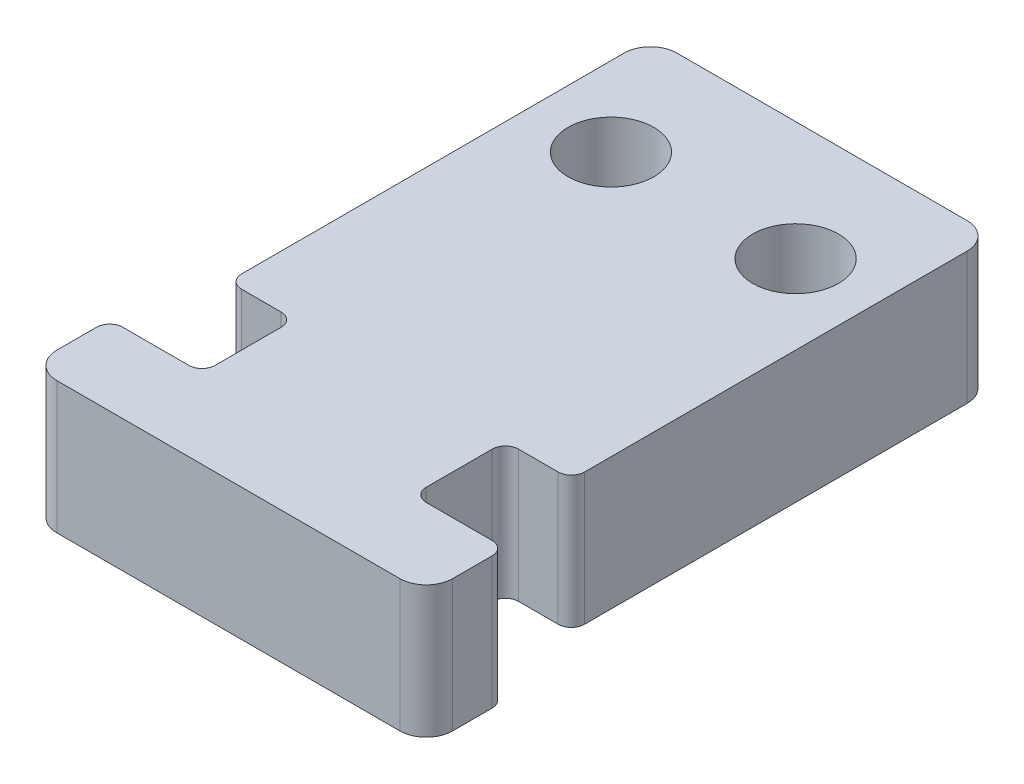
ISO-10303-21;
HEADER;
FILE_DESCRIPTION(('STEP AP214'),'2;1');
FILE_NAME('part.step','',(''),(''),'','','');
FILE_SCHEMA(('AUTOMOTIVE_DESIGN { 1 0 10303 214 1 1 1 1 }'));
ENDSEC;
DATA;
#1=APPLICATION_CONTEXT('core data for automotive mechanical design processes');
#2=APPLICATION_PROTOCOL_DEFINITION('international standard','automotive_design',2000,#1);
#3=PRODUCT_CONTEXT('',#1,'mechanical');
#4=PRODUCT('Part','Part','',(#3));
#5=PRODUCT_RELATED_PRODUCT_CATEGORY('part','',(#4));
#6=PRODUCT_DEFINITION_FORMATION('','',#4);
#7=PRODUCT_DEFINITION_CONTEXT('part definition',#1,'design');
#8=PRODUCT_DEFINITION('design','',#6,#7);
#9=PRODUCT_DEFINITION_SHAPE('','',#8);
#10=(LENGTH_UNIT() NAMED_UNIT(*) SI_UNIT(.MILLI.,.METRE.));
#11=(NAMED_UNIT(*) PLANE_ANGLE_UNIT() SI_UNIT($,.RADIAN.));
#12=(NAMED_UNIT(*) SI_UNIT($,.STERADIAN.) SOLID_ANGLE_UNIT());
#13=UNCERTAINTY_MEASURE_WITH_UNIT(LENGTH_MEASURE(1.E-05),#10,'distance_accuracy_value','');
#14=(GEOMETRIC_REPRESENTATION_CONTEXT(3) GLOBAL_UNCERTAINTY_ASSIGNED_CONTEXT((#13)) GLOBAL_UNIT_ASSIGNED_CONTEXT((#10,
#11,#12)) REPRESENTATION_CONTEXT('',''));
#15=CARTESIAN_POINT('',(0.,0.,0.));
#16=DIRECTION('',(0.,0.,1.));
#17=DIRECTION('',(1.,0.,0.));
#18=AXIS2_PLACEMENT_3D('',#15,#16,#17);
#19=CARTESIAN_POINT('',(-15.,10.,-6.));
#20=DIRECTION('',(1.,0.,0.));
#21=DIRECTION('',(0.,0.,-1.));
#22=AXIS2_PLACEMENT_3D('',#19,#20,#21);
#23=PLANE('',#22);
#24=DIRECTION('',(0.,0.,1.));
#25=VECTOR('',#24,1.);
#26=CARTESIAN_POINT('',(-15.,10.,-6.));
#27=LINE('',#26,#25);
#28=CARTESIAN_POINT('',(-15.,10.,-5.));
#29=VERTEX_POINT('',#28);
#30=CARTESIAN_POINT('',(-15.,10.,-2.));
#31=VERTEX_POINT('',#30);
#32=EDGE_CURVE('E259',#29,#31,#27,.T.);
#33=ORIENTED_EDGE('',*,*,#32,.F.);
#34=DIRECTION('',(0.,-1.,0.));
#35=VECTOR('',#34,1.);
#36=CARTESIAN_POINT('',(-15.,10.,-5.));
#37=LINE('',#36,#35);
#38=CARTESIAN_POINT('',(-15.,0.,-5.));
#39=VERTEX_POINT('',#38);
#40=EDGE_CURVE('E342',#29,#39,#37,.T.);
#41=ORIENTED_EDGE('',*,*,#40,.T.);
#42=DIRECTION('',(0.,0.,1.));
#43=VECTOR('',#42,1.);
#44=CARTESIAN_POINT('',(-15.,0.,-6.));
#45=LINE('',#44,#43);
#46=CARTESIAN_POINT('',(-15.,0.,-2.));
#47=VERTEX_POINT('',#46);
#48=EDGE_CURVE('E234',#39,#47,#45,.T.);
#49=ORIENTED_EDGE('',*,*,#48,.T.);
#50=DIRECTION('',(0.,-1.,0.));
#51=VECTOR('',#50,1.);
#52=CARTESIAN_POINT('',(-15.,10.,-2.));
#53=LINE('',#52,#51);
#54=EDGE_CURVE('E278',#47,#31,#53,.F.);
#55=ORIENTED_EDGE('',*,*,#54,.T.);
#56=EDGE_LOOP('',(#33,#41,#49,#55));
#57=FACE_BOUND('',#56,.T.);
#58=ADVANCED_FACE('F39',(#57),#23,.F.);
#59=CARTESIAN_POINT('',(15.,10.,0.));
#60=DIRECTION('',(0.,0.,-1.));
#61=DIRECTION('',(-1.,0.,0.));
#62=AXIS2_PLACEMENT_3D('',#59,#60,#61);
#63=PLANE('',#62);
#64=DIRECTION('',(1.,0.,0.));
#65=VECTOR('',#64,1.);
#66=CARTESIAN_POINT('',(15.,0.,0.));
#67=LINE('',#66,#65);
#68=CARTESIAN_POINT('',(-13.,0.,0.));
#69=VERTEX_POINT('',#68);
#70=CARTESIAN_POINT('',(13.,0.,0.));
#71=VERTEX_POINT('',#70);
#72=EDGE_CURVE('E229',#69,#71,#67,.T.);
#73=ORIENTED_EDGE('',*,*,#72,.T.);
#74=DIRECTION('',(0.,-1.,0.));
#75=VECTOR('',#74,1.);
#76=CARTESIAN_POINT('',(13.,10.,0.));
#77=LINE('',#76,#75);
#78=CARTESIAN_POINT('',(13.,10.,0.));
#79=VERTEX_POINT('',#78);
#80=EDGE_CURVE('E205',#71,#79,#77,.F.);
#81=ORIENTED_EDGE('',*,*,#80,.T.);
#82=DIRECTION('',(1.,0.,0.));
#83=VECTOR('',#82,1.);
#84=CARTESIAN_POINT('',(15.,10.,0.));
#85=LINE('',#84,#83);
#86=CARTESIAN_POINT('',(-13.,10.,0.));
#87=VERTEX_POINT('',#86);
#88=EDGE_CURVE('E412',#87,#79,#85,.T.);
#89=ORIENTED_EDGE('',*,*,#88,.F.);
#90=DIRECTION('',(0.,-1.,0.));
#91=VECTOR('',#90,1.);
#92=CARTESIAN_POINT('',(-13.,10.,0.));
#93=LINE('',#92,#91);
#94=EDGE_CURVE('E210',#87,#69,#93,.T.);
#95=ORIENTED_EDGE('',*,*,#94,.T.);
#96=EDGE_LOOP('',(#73,#81,#89,#95));
#97=FACE_BOUND('',#96,.T.);
#98=ADVANCED_FACE('F427',(#97),#63,.F.);
#99=CARTESIAN_POINT('',(15.,10.,-6.));
#100=DIRECTION('',(-1.,0.,0.));
#101=DIRECTION('',(0.,0.,1.));
#102=AXIS2_PLACEMENT_3D('',#99,#100,#101);
#103=PLANE('',#102);
#104=DIRECTION('',(0.,0.,-1.));
#105=VECTOR('',#104,1.);
#106=CARTESIAN_POINT('',(15.,0.,-6.));
#107=LINE('',#106,#105);
#108=CARTESIAN_POINT('',(15.,0.,-2.));
#109=VERTEX_POINT('',#108);
#110=CARTESIAN_POINT('',(15.,0.,-5.));
#111=VERTEX_POINT('',#110);
#112=EDGE_CURVE('E217',#109,#111,#107,.T.);
#113=ORIENTED_EDGE('',*,*,#112,.T.);
#114=DIRECTION('',(0.,-1.,0.));
#115=VECTOR('',#114,1.);
#116=CARTESIAN_POINT('',(15.,10.,-5.));
#117=LINE('',#116,#115);
#118=CARTESIAN_POINT('',(15.,10.,-5.));
#119=VERTEX_POINT('',#118);
#120=EDGE_CURVE('E340',#111,#119,#117,.F.);
#121=ORIENTED_EDGE('',*,*,#120,.T.);
#122=DIRECTION('',(0.,0.,-1.));
#123=VECTOR('',#122,1.);
#124=CARTESIAN_POINT('',(15.,10.,-6.));
#125=LINE('',#124,#123);
#126=CARTESIAN_POINT('',(15.,10.,-2.));
#127=VERTEX_POINT('',#126);
#128=EDGE_CURVE('E220',#127,#119,#125,.T.);
#129=ORIENTED_EDGE('',*,*,#128,.F.);
#130=DIRECTION('',(0.,-1.,0.));
#131=VECTOR('',#130,1.);
#132=CARTESIAN_POINT('',(15.,10.,-2.));
#133=LINE('',#132,#131);
#134=EDGE_CURVE('E204',#127,#109,#133,.T.);
#135=ORIENTED_EDGE('',*,*,#134,.T.);
#136=EDGE_LOOP('',(#113,#121,#129,#135));
#137=FACE_BOUND('',#136,.T.);
#138=ADVANCED_FACE('F216',(#137),#103,.F.);
#139=CARTESIAN_POINT('',(15.,10.,-6.));
#140=DIRECTION('',(0.,0.,1.));
#141=DIRECTION('',(1.,0.,0.));
#142=AXIS2_PLACEMENT_3D('',#139,#140,#141);
#143=PLANE('',#142);
#144=DIRECTION('',(-1.,0.,0.));
#145=VECTOR('',#144,1.);
#146=CARTESIAN_POINT('',(15.,0.,-6.));
#147=LINE('',#146,#145);
#148=CARTESIAN_POINT('',(14.,0.,-6.));
#149=VERTEX_POINT('',#148);
#150=CARTESIAN_POINT('',(9.,0.,-6.));
#151=VERTEX_POINT('',#150);
#152=EDGE_CURVE('E228',#149,#151,#147,.T.);
#153=ORIENTED_EDGE('',*,*,#152,.T.);
#154=DIRECTION('',(0.,-1.,0.));
#155=VECTOR('',#154,1.);
#156=CARTESIAN_POINT('',(9.,10.,-6.));
#157=LINE('',#156,#155);
#158=CARTESIAN_POINT('',(9.,10.,-6.));
#159=VERTEX_POINT('',#158);
#160=EDGE_CURVE('E338',#151,#159,#157,.F.);
#161=ORIENTED_EDGE('',*,*,#160,.T.);
#162=DIRECTION('',(-1.,0.,0.));
#163=VECTOR('',#162,1.);
#164=CARTESIAN_POINT('',(15.,10.,-6.));
#165=LINE('',#164,#163);
#166=CARTESIAN_POINT('',(14.,10.,-6.));
#167=VERTEX_POINT('',#166);
#168=EDGE_CURVE('E373',#167,#159,#165,.T.);
#169=ORIENTED_EDGE('',*,*,#168,.F.);
#170=DIRECTION('',(0.,-1.,0.));
#171=VECTOR('',#170,1.);
#172=CARTESIAN_POINT('',(14.,10.,-6.));
#173=LINE('',#172,#171);
#174=EDGE_CURVE('E335',#167,#149,#173,.T.);
#175=ORIENTED_EDGE('',*,*,#174,.T.);
#176=EDGE_LOOP('',(#153,#161,#169,#175));
#177=FACE_BOUND('',#176,.T.);
#178=ADVANCED_FACE('F361',(#177),#143,.F.);
#179=CARTESIAN_POINT('',(8.,10.,-13.));
#180=DIRECTION('',(-1.,0.,0.));
#181=DIRECTION('',(0.,0.,1.));
#182=AXIS2_PLACEMENT_3D('',#179,#180,#181);
#183=PLANE('',#182);
#184=DIRECTION('',(0.,0.,-1.));
#185=VECTOR('',#184,1.);
#186=CARTESIAN_POINT('',(8.,0.,-13.));
#187=LINE('',#186,#185);
#188=CARTESIAN_POINT('',(8.,0.,-7.));
#189=VERTEX_POINT('',#188);
#190=CARTESIAN_POINT('',(8.,0.,-12.));
#191=VERTEX_POINT('',#190);
#192=EDGE_CURVE('E232',#189,#191,#187,.T.);
#193=ORIENTED_EDGE('',*,*,#192,.T.);
#194=DIRECTION('',(0.,-1.,0.));
#195=VECTOR('',#194,1.);
#196=CARTESIAN_POINT('',(8.,10.,-12.));
#197=LINE('',#196,#195);
#198=CARTESIAN_POINT('',(8.,10.,-12.));
#199=VERTEX_POINT('',#198);
#200=EDGE_CURVE('E333',#191,#199,#197,.F.);
#201=ORIENTED_EDGE('',*,*,#200,.T.);
#202=DIRECTION('',(0.,0.,-1.));
#203=VECTOR('',#202,1.);
#204=CARTESIAN_POINT('',(8.,10.,-13.));
#205=LINE('',#204,#203);
#206=CARTESIAN_POINT('',(8.,10.,-7.));
#207=VERTEX_POINT('',#206);
#208=EDGE_CURVE('E371',#207,#199,#205,.T.);
#209=ORIENTED_EDGE('',*,*,#208,.F.);
#210=DIRECTION('',(0.,-1.,0.));
#211=VECTOR('',#210,1.);
#212=CARTESIAN_POINT('',(8.,0.,-7.));
#213=LINE('',#212,#211);
#214=EDGE_CURVE('E330',#207,#189,#213,.T.);
#215=ORIENTED_EDGE('',*,*,#214,.T.);
#216=EDGE_LOOP('',(#193,#201,#209,#215));
#217=FACE_BOUND('',#216,.T.);
#218=ADVANCED_FACE('F375',(#217),#183,.F.);
#219=CARTESIAN_POINT('',(13.,10.,-13.));
#220=DIRECTION('',(0.,0.,-1.));
#221=DIRECTION('',(-1.,0.,0.));
#222=AXIS2_PLACEMENT_3D('',#219,#220,#221);
#223=PLANE('',#222);
#224=DIRECTION('',(1.,0.,0.));
#225=VECTOR('',#224,1.);
#226=CARTESIAN_POINT('',(13.,0.,-13.));
#227=LINE('',#226,#225);
#228=CARTESIAN_POINT('',(9.,0.,-13.));
#229=VERTEX_POINT('',#228);
#230=CARTESIAN_POINT('',(12.,0.,-13.));
#231=VERTEX_POINT('',#230);
#232=EDGE_CURVE('E240',#229,#231,#227,.T.);
#233=ORIENTED_EDGE('',*,*,#232,.T.);
#234=DIRECTION('',(0.,-1.,0.));
#235=VECTOR('',#234,1.);
#236=CARTESIAN_POINT('',(12.,10.,-13.));
#237=LINE('',#236,#235);
#238=CARTESIAN_POINT('',(12.,10.,-13.));
#239=VERTEX_POINT('',#238);
#240=EDGE_CURVE('E328',#231,#239,#237,.F.);
#241=ORIENTED_EDGE('',*,*,#240,.T.);
#242=DIRECTION('',(1.,0.,0.));
#243=VECTOR('',#242,1.);
#244=CARTESIAN_POINT('',(13.,10.,-13.));
#245=LINE('',#244,#243);
#246=CARTESIAN_POINT('',(9.,10.,-13.));
#247=VERTEX_POINT('',#246);
#248=EDGE_CURVE('E377',#247,#239,#245,.T.);
#249=ORIENTED_EDGE('',*,*,#248,.F.);
#250=DIRECTION('',(0.,-1.,0.));
#251=VECTOR('',#250,1.);
#252=CARTESIAN_POINT('',(9.,0.,-13.));
#253=LINE('',#252,#251);
#254=EDGE_CURVE('E325',#247,#229,#253,.T.);
#255=ORIENTED_EDGE('',*,*,#254,.T.);
#256=EDGE_LOOP('',(#233,#241,#249,#255));
#257=FACE_BOUND('',#256,.T.);
#258=ADVANCED_FACE('F473',(#257),#223,.F.);
#259=CARTESIAN_POINT('',(13.,10.,-45.));
#260=DIRECTION('',(-1.,0.,0.));
#261=DIRECTION('',(0.,0.,1.));
#262=AXIS2_PLACEMENT_3D('',#259,#260,#261);
#263=PLANE('',#262);
#264=DIRECTION('',(0.,0.,-1.));
#265=VECTOR('',#264,1.);
#266=CARTESIAN_POINT('',(13.,10.,-45.));
#267=LINE('',#266,#265);
#268=CARTESIAN_POINT('',(13.,10.,-14.));
#269=VERTEX_POINT('',#268);
#270=CARTESIAN_POINT('',(13.,10.,-43.));
#271=VERTEX_POINT('',#270);
#272=EDGE_CURVE('E379',#269,#271,#267,.T.);
#273=ORIENTED_EDGE('',*,*,#272,.F.);
#274=DIRECTION('',(0.,-1.,0.));
#275=VECTOR('',#274,1.);
#276=CARTESIAN_POINT('',(13.,10.,-14.));
#277=LINE('',#276,#275);
#278=CARTESIAN_POINT('',(13.,0.,-14.));
#279=VERTEX_POINT('',#278);
#280=EDGE_CURVE('E322',#269,#279,#277,.T.);
#281=ORIENTED_EDGE('',*,*,#280,.T.);
#282=DIRECTION('',(0.,0.,-1.));
#283=VECTOR('',#282,1.);
#284=CARTESIAN_POINT('',(13.,0.,-45.));
#285=LINE('',#284,#283);
#286=CARTESIAN_POINT('',(13.,0.,-43.));
#287=VERTEX_POINT('',#286);
#288=EDGE_CURVE('E243',#279,#287,#285,.T.);
#289=ORIENTED_EDGE('',*,*,#288,.T.);
#290=DIRECTION('',(0.,-1.,0.));
#291=VECTOR('',#290,1.);
#292=CARTESIAN_POINT('',(13.,10.,-43.));
#293=LINE('',#292,#291);
#294=EDGE_CURVE('E289',#287,#271,#293,.F.);
#295=ORIENTED_EDGE('',*,*,#294,.T.);
#296=EDGE_LOOP('',(#273,#281,#289,#295));
#297=FACE_BOUND('',#296,.T.);
#298=ADVANCED_FACE('F479',(#297),#263,.F.);
#299=CARTESIAN_POINT('',(13.,10.,-45.));
#300=DIRECTION('',(0.,0.,1.));
#301=DIRECTION('',(1.,0.,0.));
#302=AXIS2_PLACEMENT_3D('',#299,#300,#301);
#303=PLANE('',#302);
#304=DIRECTION('',(-1.,0.,0.));
#305=VECTOR('',#304,1.);
#306=CARTESIAN_POINT('',(13.,0.,-45.));
#307=LINE('',#306,#305);
#308=CARTESIAN_POINT('',(11.,0.,-45.));
#309=VERTEX_POINT('',#308);
#310=CARTESIAN_POINT('',(-11.,0.,-45.));
#311=VERTEX_POINT('',#310);
#312=EDGE_CURVE('E245',#309,#311,#307,.T.);
#313=ORIENTED_EDGE('',*,*,#312,.T.);
#314=DIRECTION('',(0.,-1.,0.));
#315=VECTOR('',#314,1.);
#316=CARTESIAN_POINT('',(-11.,10.,-45.));
#317=LINE('',#316,#315);
#318=CARTESIAN_POINT('',(-11.,10.,-45.));
#319=VERTEX_POINT('',#318);
#320=EDGE_CURVE('E287',#311,#319,#317,.F.);
#321=ORIENTED_EDGE('',*,*,#320,.T.);
#322=DIRECTION('',(-1.,0.,0.));
#323=VECTOR('',#322,1.);
#324=CARTESIAN_POINT('',(13.,10.,-45.));
#325=LINE('',#324,#323);
#326=CARTESIAN_POINT('',(11.,10.,-45.));
#327=VERTEX_POINT('',#326);
#328=EDGE_CURVE('E385',#327,#319,#325,.T.);
#329=ORIENTED_EDGE('',*,*,#328,.F.);
#330=DIRECTION('',(0.,-1.,0.));
#331=VECTOR('',#330,1.);
#332=CARTESIAN_POINT('',(11.,10.,-45.));
#333=LINE('',#332,#331);
#334=EDGE_CURVE('E284',#327,#309,#333,.T.);
#335=ORIENTED_EDGE('',*,*,#334,.T.);
#336=EDGE_LOOP('',(#313,#321,#329,#335));
#337=FACE_BOUND('',#336,.T.);
#338=ADVANCED_FACE('F487',(#337),#303,.F.);
#339=CARTESIAN_POINT('',(-13.,10.,-45.));
#340=DIRECTION('',(1.,0.,0.));
#341=DIRECTION('',(0.,0.,-1.));
#342=AXIS2_PLACEMENT_3D('',#339,#340,#341);
#343=PLANE('',#342);
#344=DIRECTION('',(0.,0.,1.));
#345=VECTOR('',#344,1.);
#346=CARTESIAN_POINT('',(-13.,0.,-45.));
#347=LINE('',#346,#345);
#348=CARTESIAN_POINT('',(-13.,0.,-43.));
#349=VERTEX_POINT('',#348);
#350=CARTESIAN_POINT('',(-13.,0.,-14.));
#351=VERTEX_POINT('',#350);
#352=EDGE_CURVE('E248',#349,#351,#347,.T.);
#353=ORIENTED_EDGE('',*,*,#352,.T.);
#354=DIRECTION('',(0.,-1.,0.));
#355=VECTOR('',#354,1.);
#356=CARTESIAN_POINT('',(-13.,10.,-14.));
#357=LINE('',#356,#355);
#358=CARTESIAN_POINT('',(-13.,10.,-14.));
#359=VERTEX_POINT('',#358);
#360=EDGE_CURVE('E314',#351,#359,#357,.F.);
#361=ORIENTED_EDGE('',*,*,#360,.T.);
#362=DIRECTION('',(0.,0.,1.));
#363=VECTOR('',#362,1.);
#364=CARTESIAN_POINT('',(-13.,10.,-45.));
#365=LINE('',#364,#363);
#366=CARTESIAN_POINT('',(-13.,10.,-43.));
#367=VERTEX_POINT('',#366);
#368=EDGE_CURVE('E388',#367,#359,#365,.T.);
#369=ORIENTED_EDGE('',*,*,#368,.F.);
#370=DIRECTION('',(0.,-1.,0.));
#371=VECTOR('',#370,1.);
#372=CARTESIAN_POINT('',(-13.,10.,-43.));
#373=LINE('',#372,#371);
#374=EDGE_CURVE('E281',#367,#349,#373,.T.);
#375=ORIENTED_EDGE('',*,*,#374,.T.);
#376=EDGE_LOOP('',(#353,#361,#369,#375));
#377=FACE_BOUND('',#376,.T.);
#378=ADVANCED_FACE('F493',(#377),#343,.F.);
#379=CARTESIAN_POINT('',(-13.,10.,-13.));
#380=DIRECTION('',(0.,0.,-1.));
#381=DIRECTION('',(-1.,0.,0.));
#382=AXIS2_PLACEMENT_3D('',#379,#380,#381);
#383=PLANE('',#382);
#384=DIRECTION('',(1.,0.,0.));
#385=VECTOR('',#384,1.);
#386=CARTESIAN_POINT('',(-13.,0.,-13.));
#387=LINE('',#386,#385);
#388=CARTESIAN_POINT('',(-12.,0.,-13.));
#389=VERTEX_POINT('',#388);
#390=CARTESIAN_POINT('',(-9.,0.,-13.));
#391=VERTEX_POINT('',#390);
#392=EDGE_CURVE('E251',#389,#391,#387,.T.);
#393=ORIENTED_EDGE('',*,*,#392,.T.);
#394=DIRECTION('',(0.,-1.,0.));
#395=VECTOR('',#394,1.);
#396=CARTESIAN_POINT('',(-9.,10.,-13.));
#397=LINE('',#396,#395);
#398=CARTESIAN_POINT('',(-9.,10.,-13.));
#399=VERTEX_POINT('',#398);
#400=EDGE_CURVE('E305',#391,#399,#397,.F.);
#401=ORIENTED_EDGE('',*,*,#400,.T.);
#402=DIRECTION('',(1.,0.,0.));
#403=VECTOR('',#402,1.);
#404=CARTESIAN_POINT('',(-13.,10.,-13.));
#405=LINE('',#404,#403);
#406=CARTESIAN_POINT('',(-12.,10.,-13.));
#407=VERTEX_POINT('',#406);
#408=EDGE_CURVE('E390',#407,#399,#405,.T.);
#409=ORIENTED_EDGE('',*,*,#408,.F.);
#410=DIRECTION('',(0.,-1.,0.));
#411=VECTOR('',#410,1.);
#412=CARTESIAN_POINT('',(-12.,10.,-13.));
#413=LINE('',#412,#411);
#414=EDGE_CURVE('E302',#407,#389,#413,.T.);
#415=ORIENTED_EDGE('',*,*,#414,.T.);
#416=EDGE_LOOP('',(#393,#401,#409,#415));
#417=FACE_BOUND('',#416,.T.);
#418=ADVANCED_FACE('F500',(#417),#383,.F.);
#419=CARTESIAN_POINT('',(-8.,10.,-13.));
#420=DIRECTION('',(1.,0.,0.));
#421=DIRECTION('',(0.,0.,-1.));
#422=AXIS2_PLACEMENT_3D('',#419,#420,#421);
#423=PLANE('',#422);
#424=DIRECTION('',(0.,0.,1.));
#425=VECTOR('',#424,1.);
#426=CARTESIAN_POINT('',(-8.,0.,-13.));
#427=LINE('',#426,#425);
#428=CARTESIAN_POINT('',(-8.,0.,-12.));
#429=VERTEX_POINT('',#428);
#430=CARTESIAN_POINT('',(-8.,0.,-7.));
#431=VERTEX_POINT('',#430);
#432=EDGE_CURVE('E254',#429,#431,#427,.T.);
#433=ORIENTED_EDGE('',*,*,#432,.T.);
#434=DIRECTION('',(0.,-1.,0.));
#435=VECTOR('',#434,1.);
#436=CARTESIAN_POINT('',(-8.,10.,-7.));
#437=LINE('',#436,#435);
#438=CARTESIAN_POINT('',(-8.,10.,-7.));
#439=VERTEX_POINT('',#438);
#440=EDGE_CURVE('E300',#431,#439,#437,.F.);
#441=ORIENTED_EDGE('',*,*,#440,.T.);
#442=DIRECTION('',(0.,0.,1.));
#443=VECTOR('',#442,1.);
#444=CARTESIAN_POINT('',(-8.,10.,-13.));
#445=LINE('',#444,#443);
#446=CARTESIAN_POINT('',(-8.,10.,-12.));
#447=VERTEX_POINT('',#446);
#448=EDGE_CURVE('E393',#447,#439,#445,.T.);
#449=ORIENTED_EDGE('',*,*,#448,.F.);
#450=DIRECTION('',(0.,-1.,0.));
#451=VECTOR('',#450,1.);
#452=CARTESIAN_POINT('',(-8.,0.,-12.));
#453=LINE('',#452,#451);
#454=EDGE_CURVE('E297',#447,#429,#453,.T.);
#455=ORIENTED_EDGE('',*,*,#454,.T.);
#456=EDGE_LOOP('',(#433,#441,#449,#455));
#457=FACE_BOUND('',#456,.T.);
#458=ADVANCED_FACE('F506',(#457),#423,.F.);
#459=CARTESIAN_POINT('',(-15.,10.,-6.));
#460=DIRECTION('',(0.,0.,1.));
#461=DIRECTION('',(1.,0.,0.));
#462=AXIS2_PLACEMENT_3D('',#459,#460,#461);
#463=PLANE('',#462);
#464=DIRECTION('',(-1.,0.,0.));
#465=VECTOR('',#464,1.);
#466=CARTESIAN_POINT('',(-15.,10.,-6.));
#467=LINE('',#466,#465);
#468=CARTESIAN_POINT('',(-9.,10.,-6.));
#469=VERTEX_POINT('',#468);
#470=CARTESIAN_POINT('',(-14.,10.,-6.));
#471=VERTEX_POINT('',#470);
#472=EDGE_CURVE('E222',#469,#471,#467,.T.);
#473=ORIENTED_EDGE('',*,*,#472,.F.);
#474=DIRECTION('',(0.,-1.,0.));
#475=VECTOR('',#474,1.);
#476=CARTESIAN_POINT('',(-9.,0.,-6.));
#477=LINE('',#476,#475);
#478=CARTESIAN_POINT('',(-9.,0.,-6.));
#479=VERTEX_POINT('',#478);
#480=EDGE_CURVE('E294',#469,#479,#477,.T.);
#481=ORIENTED_EDGE('',*,*,#480,.T.);
#482=DIRECTION('',(-1.,0.,0.));
#483=VECTOR('',#482,1.);
#484=CARTESIAN_POINT('',(-15.,0.,-6.));
#485=LINE('',#484,#483);
#486=CARTESIAN_POINT('',(-14.,0.,-6.));
#487=VERTEX_POINT('',#486);
#488=EDGE_CURVE('E257',#479,#487,#485,.T.);
#489=ORIENTED_EDGE('',*,*,#488,.T.);
#490=DIRECTION('',(0.,-1.,0.));
#491=VECTOR('',#490,1.);
#492=CARTESIAN_POINT('',(-14.,10.,-6.));
#493=LINE('',#492,#491);
#494=EDGE_CURVE('E292',#487,#471,#493,.F.);
#495=ORIENTED_EDGE('',*,*,#494,.T.);
#496=EDGE_LOOP('',(#473,#481,#489,#495));
#497=FACE_BOUND('',#496,.T.);
#498=ADVANCED_FACE('F512',(#497),#463,.F.);
#499=CARTESIAN_POINT('',(0.,10.,0.));
#500=DIRECTION('',(0.,-1.,0.));
#501=DIRECTION('',(0.,0.,-1.));
#502=AXIS2_PLACEMENT_3D('',#499,#500,#501);
#503=PLANE('',#502);
#504=CARTESIAN_POINT('',(-6.99999999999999,10.,-36.));
#505=DIRECTION('',(0.,-1.,0.));
#506=DIRECTION('',(0.,0.,1.));
#507=AXIS2_PLACEMENT_3D('',#504,#505,#506);
#508=CIRCLE('',#507,3.25000000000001);
#509=CARTESIAN_POINT('',(-6.99999999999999,10.,-32.75));
#510=VERTEX_POINT('',#509);
#511=EDGE_CURVE('E408',#510,#510,#508,.T.);
#512=ORIENTED_EDGE('',*,*,#511,.T.);
#513=EDGE_LOOP('',(#512));
#514=FACE_BOUND('',#513,.T.);
#515=CARTESIAN_POINT('',(6.99999999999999,10.,-36.));
#516=DIRECTION('',(0.,1.,0.));
#517=DIRECTION('',(0.,0.,1.));
#518=AXIS2_PLACEMENT_3D('',#515,#516,#517);
#519=CIRCLE('',#518,3.25000000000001);
#520=CARTESIAN_POINT('',(6.99999999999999,10.,-32.75));
#521=VERTEX_POINT('',#520);
#522=EDGE_CURVE('E400',#521,#521,#519,.T.);
#523=ORIENTED_EDGE('',*,*,#522,.F.);
#524=EDGE_LOOP('',(#523));
#525=FACE_BOUND('',#524,.T.);
#526=ORIENTED_EDGE('',*,*,#368,.T.);
#527=CARTESIAN_POINT('',(-12.,10.,-14.));
#528=DIRECTION('',(0.,-1.,0.));
#529=DIRECTION('',(0.,0.,-1.));
#530=AXIS2_PLACEMENT_3D('',#527,#528,#529);
#531=CIRCLE('',#530,1.);
#532=EDGE_CURVE('E320',#359,#407,#531,.F.);
#533=ORIENTED_EDGE('',*,*,#532,.T.);
#534=ORIENTED_EDGE('',*,*,#408,.T.);
#535=CARTESIAN_POINT('',(-9.,10.,-12.));
#536=DIRECTION('',(0.,-1.,0.));
#537=DIRECTION('',(0.,0.,-1.));
#538=AXIS2_PLACEMENT_3D('',#535,#536,#537);
#539=CIRCLE('',#538,1.);
#540=EDGE_CURVE('E351',#399,#447,#539,.T.);
#541=ORIENTED_EDGE('',*,*,#540,.T.);
#542=ORIENTED_EDGE('',*,*,#448,.T.);
#543=CARTESIAN_POINT('',(-9.,10.,-7.));
#544=DIRECTION('',(0.,-1.,0.));
#545=DIRECTION('',(0.,0.,-1.));
#546=AXIS2_PLACEMENT_3D('',#543,#544,#545);
#547=CIRCLE('',#546,1.);
#548=EDGE_CURVE('E347',#439,#469,#547,.T.);
#549=ORIENTED_EDGE('',*,*,#548,.T.);
#550=ORIENTED_EDGE('',*,*,#472,.T.);
#551=CARTESIAN_POINT('',(-14.,10.,-5.));
#552=DIRECTION('',(0.,-1.,0.));
#553=DIRECTION('',(0.,0.,-1.));
#554=AXIS2_PLACEMENT_3D('',#551,#552,#553);
#555=CIRCLE('',#554,1.);
#556=EDGE_CURVE('E54',#471,#29,#555,.F.);
#557=ORIENTED_EDGE('',*,*,#556,.T.);
#558=ORIENTED_EDGE('',*,*,#32,.T.);
#559=CARTESIAN_POINT('',(-13.,10.,-2.));
#560=DIRECTION('',(0.,-1.,0.));
#561=DIRECTION('',(0.,0.,-1.));
#562=AXIS2_PLACEMENT_3D('',#559,#560,#561);
#563=CIRCLE('',#562,2.);
#564=EDGE_CURVE('E274',#31,#87,#563,.F.);
#565=ORIENTED_EDGE('',*,*,#564,.T.);
#566=ORIENTED_EDGE('',*,*,#88,.T.);
#567=CARTESIAN_POINT('',(13.,10.,-2.));
#568=DIRECTION('',(0.,-1.,0.));
#569=DIRECTION('',(0.,0.,-1.));
#570=AXIS2_PLACEMENT_3D('',#567,#568,#569);
#571=CIRCLE('',#570,2.);
#572=EDGE_CURVE('E276',#79,#127,#571,.F.);
#573=ORIENTED_EDGE('',*,*,#572,.T.);
#574=ORIENTED_EDGE('',*,*,#128,.T.);
#575=CARTESIAN_POINT('',(14.,10.,-5.));
#576=DIRECTION('',(0.,-1.,0.));
#577=DIRECTION('',(0.,0.,-1.));
#578=AXIS2_PLACEMENT_3D('',#575,#576,#577);
#579=CIRCLE('',#578,1.);
#580=EDGE_CURVE('E317',#119,#167,#579,.F.);
#581=ORIENTED_EDGE('',*,*,#580,.T.);
#582=ORIENTED_EDGE('',*,*,#168,.T.);
#583=CARTESIAN_POINT('',(9.,10.,-7.));
#584=DIRECTION('',(0.,-1.,0.));
#585=DIRECTION('',(0.,0.,-1.));
#586=AXIS2_PLACEMENT_3D('',#583,#584,#585);
#587=CIRCLE('',#586,1.);
#588=EDGE_CURVE('E11',#159,#207,#587,.T.);
#589=ORIENTED_EDGE('',*,*,#588,.T.);
#590=ORIENTED_EDGE('',*,*,#208,.T.);
#591=CARTESIAN_POINT('',(9.,10.,-12.));
#592=DIRECTION('',(0.,-1.,0.));
#593=DIRECTION('',(0.,0.,-1.));
#594=AXIS2_PLACEMENT_3D('',#591,#592,#593);
#595=CIRCLE('',#594,1.);
#596=EDGE_CURVE('E355',#199,#247,#595,.T.);
#597=ORIENTED_EDGE('',*,*,#596,.T.);
#598=ORIENTED_EDGE('',*,*,#248,.T.);
#599=CARTESIAN_POINT('',(12.,10.,-14.));
#600=DIRECTION('',(0.,-1.,0.));
#601=DIRECTION('',(0.,0.,-1.));
#602=AXIS2_PLACEMENT_3D('',#599,#600,#601);
#603=CIRCLE('',#602,1.);
#604=EDGE_CURVE('E61',#239,#269,#603,.F.);
#605=ORIENTED_EDGE('',*,*,#604,.T.);
#606=ORIENTED_EDGE('',*,*,#272,.T.);
#607=CARTESIAN_POINT('',(11.,10.,-43.));
#608=DIRECTION('',(0.,-1.,0.));
#609=DIRECTION('',(0.,0.,-1.));
#610=AXIS2_PLACEMENT_3D('',#607,#608,#609);
#611=CIRCLE('',#610,2.);
#612=EDGE_CURVE('E270',#271,#327,#611,.F.);
#613=ORIENTED_EDGE('',*,*,#612,.T.);
#614=ORIENTED_EDGE('',*,*,#328,.T.);
#615=CARTESIAN_POINT('',(-11.,10.,-43.));
#616=DIRECTION('',(0.,-1.,0.));
#617=DIRECTION('',(0.,0.,-1.));
#618=AXIS2_PLACEMENT_3D('',#615,#616,#617);
#619=CIRCLE('',#618,2.);
#620=EDGE_CURVE('E272',#319,#367,#619,.F.);
#621=ORIENTED_EDGE('',*,*,#620,.T.);
#622=EDGE_LOOP('',(#526,#533,#534,#541,#542,#549,#550,#557,#558,#565,#566,#573,#574,#581,#582,
#589,#590,#597,#598,#605,#606,#613,#614,#621));
#623=FACE_BOUND('',#622,.T.);
#624=ADVANCED_FACE('F370',(#514,#525,#623),#503,.F.);
#625=CARTESIAN_POINT('',(0.,0.,0.));
#626=DIRECTION('',(0.,-1.,0.));
#627=DIRECTION('',(0.,0.,-1.));
#628=AXIS2_PLACEMENT_3D('',#625,#626,#627);
#629=PLANE('',#628);
#630=CARTESIAN_POINT('',(-6.99999999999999,0.,-36.));
#631=DIRECTION('',(0.,-1.,0.));
#632=DIRECTION('',(0.,0.,1.));
#633=AXIS2_PLACEMENT_3D('',#630,#631,#632);
#634=CIRCLE('',#633,3.25000000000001);
#635=CARTESIAN_POINT('',(-6.99999999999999,0.,-32.75));
#636=VERTEX_POINT('',#635);
#637=EDGE_CURVE('E405',#636,#636,#634,.T.);
#638=ORIENTED_EDGE('',*,*,#637,.F.);
#639=EDGE_LOOP('',(#638));
#640=FACE_BOUND('',#639,.T.);
#641=CARTESIAN_POINT('',(6.99999999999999,0.,-36.));
#642=DIRECTION('',(0.,1.,0.));
#643=DIRECTION('',(0.,0.,1.));
#644=AXIS2_PLACEMENT_3D('',#641,#642,#643);
#645=CIRCLE('',#644,3.25000000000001);
#646=CARTESIAN_POINT('',(6.99999999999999,0.,-32.75));
#647=VERTEX_POINT('',#646);
#648=EDGE_CURVE('E396',#647,#647,#645,.T.);
#649=ORIENTED_EDGE('',*,*,#648,.T.);
#650=EDGE_LOOP('',(#649));
#651=FACE_BOUND('',#650,.T.);
#652=ORIENTED_EDGE('',*,*,#392,.F.);
#653=CARTESIAN_POINT('',(-12.,0.,-14.));
#654=DIRECTION('',(0.,-1.,0.));
#655=DIRECTION('',(0.,0.,-1.));
#656=AXIS2_PLACEMENT_3D('',#653,#654,#655);
#657=CIRCLE('',#656,1.);
#658=EDGE_CURVE('E312',#389,#351,#657,.T.);
#659=ORIENTED_EDGE('',*,*,#658,.T.);
#660=ORIENTED_EDGE('',*,*,#352,.F.);
#661=CARTESIAN_POINT('',(-11.,0.,-43.));
#662=DIRECTION('',(0.,-1.,0.));
#663=DIRECTION('',(0.,0.,-1.));
#664=AXIS2_PLACEMENT_3D('',#661,#662,#663);
#665=CIRCLE('',#664,2.);
#666=EDGE_CURVE('E263',#349,#311,#665,.T.);
#667=ORIENTED_EDGE('',*,*,#666,.T.);
#668=ORIENTED_EDGE('',*,*,#312,.F.);
#669=CARTESIAN_POINT('',(11.,0.,-43.));
#670=DIRECTION('',(0.,-1.,0.));
#671=DIRECTION('',(0.,0.,-1.));
#672=AXIS2_PLACEMENT_3D('',#669,#670,#671);
#673=CIRCLE('',#672,2.);
#674=EDGE_CURVE('E221',#309,#287,#673,.T.);
#675=ORIENTED_EDGE('',*,*,#674,.T.);
#676=ORIENTED_EDGE('',*,*,#288,.F.);
#677=CARTESIAN_POINT('',(12.,0.,-14.));
#678=DIRECTION('',(0.,-1.,0.));
#679=DIRECTION('',(0.,0.,-1.));
#680=AXIS2_PLACEMENT_3D('',#677,#678,#679);
#681=CIRCLE('',#680,1.);
#682=EDGE_CURVE('E310',#279,#231,#681,.T.);
#683=ORIENTED_EDGE('',*,*,#682,.T.);
#684=ORIENTED_EDGE('',*,*,#232,.F.);
#685=CARTESIAN_POINT('',(9.,0.,-12.));
#686=DIRECTION('',(0.,-1.,0.));
#687=DIRECTION('',(0.,0.,-1.));
#688=AXIS2_PLACEMENT_3D('',#685,#686,#687);
#689=CIRCLE('',#688,1.);
#690=EDGE_CURVE('E353',#229,#191,#689,.F.);
#691=ORIENTED_EDGE('',*,*,#690,.T.);
#692=ORIENTED_EDGE('',*,*,#192,.F.);
#693=CARTESIAN_POINT('',(9.,0.,-7.));
#694=DIRECTION('',(0.,-1.,0.));
#695=DIRECTION('',(0.,0.,-1.));
#696=AXIS2_PLACEMENT_3D('',#693,#694,#695);
#697=CIRCLE('',#696,1.);
#698=EDGE_CURVE('E47',#189,#151,#697,.F.);
#699=ORIENTED_EDGE('',*,*,#698,.T.);
#700=ORIENTED_EDGE('',*,*,#152,.F.);
#701=CARTESIAN_POINT('',(14.,0.,-5.));
#702=DIRECTION('',(0.,-1.,0.));
#703=DIRECTION('',(0.,0.,-1.));
#704=AXIS2_PLACEMENT_3D('',#701,#702,#703);
#705=CIRCLE('',#704,1.);
#706=EDGE_CURVE('E227',#149,#111,#705,.T.);
#707=ORIENTED_EDGE('',*,*,#706,.T.);
#708=ORIENTED_EDGE('',*,*,#112,.F.);
#709=CARTESIAN_POINT('',(13.,0.,-2.));
#710=DIRECTION('',(0.,-1.,0.));
#711=DIRECTION('',(0.,0.,-1.));
#712=AXIS2_PLACEMENT_3D('',#709,#710,#711);
#713=CIRCLE('',#712,2.);
#714=EDGE_CURVE('E200',#109,#71,#713,.T.);
#715=ORIENTED_EDGE('',*,*,#714,.T.);
#716=ORIENTED_EDGE('',*,*,#72,.F.);
#717=CARTESIAN_POINT('',(-13.,0.,-2.));
#718=DIRECTION('',(0.,-1.,0.));
#719=DIRECTION('',(0.,0.,-1.));
#720=AXIS2_PLACEMENT_3D('',#717,#718,#719);
#721=CIRCLE('',#720,2.);
#722=EDGE_CURVE('E211',#69,#47,#721,.T.);
#723=ORIENTED_EDGE('',*,*,#722,.T.);
#724=ORIENTED_EDGE('',*,*,#48,.F.);
#725=CARTESIAN_POINT('',(-14.,0.,-5.));
#726=DIRECTION('',(0.,-1.,0.));
#727=DIRECTION('',(0.,0.,-1.));
#728=AXIS2_PLACEMENT_3D('',#725,#726,#727);
#729=CIRCLE('',#728,1.);
#730=EDGE_CURVE('E307',#39,#487,#729,.T.);
#731=ORIENTED_EDGE('',*,*,#730,.T.);
#732=ORIENTED_EDGE('',*,*,#488,.F.);
#733=CARTESIAN_POINT('',(-9.,0.,-7.));
#734=DIRECTION('',(0.,-1.,0.));
#735=DIRECTION('',(0.,0.,-1.));
#736=AXIS2_PLACEMENT_3D('',#733,#734,#735);
#737=CIRCLE('',#736,1.);
#738=EDGE_CURVE('E345',#479,#431,#737,.F.);
#739=ORIENTED_EDGE('',*,*,#738,.T.);
#740=ORIENTED_EDGE('',*,*,#432,.F.);
#741=CARTESIAN_POINT('',(-9.,0.,-12.));
#742=DIRECTION('',(0.,-1.,0.));
#743=DIRECTION('',(0.,0.,-1.));
#744=AXIS2_PLACEMENT_3D('',#741,#742,#743);
#745=CIRCLE('',#744,1.);
#746=EDGE_CURVE('E349',#429,#391,#745,.F.);
#747=ORIENTED_EDGE('',*,*,#746,.T.);
#748=EDGE_LOOP('',(#652,#659,#660,#667,#668,#675,#676,#683,#684,#691,#692,#699,#700,#707,#708,
#715,#716,#723,#724,#731,#732,#739,#740,#747));
#749=FACE_BOUND('',#748,.T.);
#750=ADVANCED_FACE('F225',(#640,#651,#749),#629,.T.);
#751=CARTESIAN_POINT('',(13.,10.,-2.));
#752=DIRECTION('',(0.,-1.,0.));
#753=DIRECTION('',(0.,0.,-1.));
#754=AXIS2_PLACEMENT_3D('',#751,#752,#753);
#755=CYLINDRICAL_SURFACE('',#754,2.);
#756=ORIENTED_EDGE('',*,*,#572,.F.);
#757=ORIENTED_EDGE('',*,*,#80,.F.);
#758=ORIENTED_EDGE('',*,*,#714,.F.);
#759=ORIENTED_EDGE('',*,*,#134,.F.);
#760=EDGE_LOOP('',(#756,#757,#758,#759));
#761=FACE_BOUND('',#760,.T.);
#762=ADVANCED_FACE('F203',(#761),#755,.T.);
#763=CARTESIAN_POINT('',(-13.,10.,-2.));
#764=DIRECTION('',(0.,-1.,0.));
#765=DIRECTION('',(0.,0.,-1.));
#766=AXIS2_PLACEMENT_3D('',#763,#764,#765);
#767=CYLINDRICAL_SURFACE('',#766,2.);
#768=ORIENTED_EDGE('',*,*,#564,.F.);
#769=ORIENTED_EDGE('',*,*,#54,.F.);
#770=ORIENTED_EDGE('',*,*,#722,.F.);
#771=ORIENTED_EDGE('',*,*,#94,.F.);
#772=EDGE_LOOP('',(#768,#769,#770,#771));
#773=FACE_BOUND('',#772,.T.);
#774=ADVANCED_FACE('F438',(#773),#767,.T.);
#775=CARTESIAN_POINT('',(-11.,10.,-43.));
#776=DIRECTION('',(0.,-1.,0.));
#777=DIRECTION('',(0.,0.,-1.));
#778=AXIS2_PLACEMENT_3D('',#775,#776,#777);
#779=CYLINDRICAL_SURFACE('',#778,2.);
#780=ORIENTED_EDGE('',*,*,#620,.F.);
#781=ORIENTED_EDGE('',*,*,#320,.F.);
#782=ORIENTED_EDGE('',*,*,#666,.F.);
#783=ORIENTED_EDGE('',*,*,#374,.F.);
#784=EDGE_LOOP('',(#780,#781,#782,#783));
#785=FACE_BOUND('',#784,.T.);
#786=ADVANCED_FACE('F441',(#785),#779,.T.);
#787=CARTESIAN_POINT('',(11.,10.,-43.));
#788=DIRECTION('',(0.,-1.,0.));
#789=DIRECTION('',(0.,0.,-1.));
#790=AXIS2_PLACEMENT_3D('',#787,#788,#789);
#791=CYLINDRICAL_SURFACE('',#790,2.);
#792=ORIENTED_EDGE('',*,*,#612,.F.);
#793=ORIENTED_EDGE('',*,*,#294,.F.);
#794=ORIENTED_EDGE('',*,*,#674,.F.);
#795=ORIENTED_EDGE('',*,*,#334,.F.);
#796=EDGE_LOOP('',(#792,#793,#794,#795));
#797=FACE_BOUND('',#796,.T.);
#798=ADVANCED_FACE('F445',(#797),#791,.T.);
#799=CARTESIAN_POINT('',(-9.,10.,-7.));
#800=DIRECTION('',(0.,1.,0.));
#801=DIRECTION('',(0.,0.,1.));
#802=AXIS2_PLACEMENT_3D('',#799,#800,#801);
#803=CYLINDRICAL_SURFACE('',#802,1.);
#804=ORIENTED_EDGE('',*,*,#548,.F.);
#805=ORIENTED_EDGE('',*,*,#440,.F.);
#806=ORIENTED_EDGE('',*,*,#738,.F.);
#807=ORIENTED_EDGE('',*,*,#480,.F.);
#808=EDGE_LOOP('',(#804,#805,#806,#807));
#809=FACE_BOUND('',#808,.T.);
#810=ADVANCED_FACE('F449',(#809),#803,.F.);
#811=CARTESIAN_POINT('',(-9.,10.,-12.));
#812=DIRECTION('',(0.,1.,0.));
#813=DIRECTION('',(0.,0.,1.));
#814=AXIS2_PLACEMENT_3D('',#811,#812,#813);
#815=CYLINDRICAL_SURFACE('',#814,1.);
#816=ORIENTED_EDGE('',*,*,#540,.F.);
#817=ORIENTED_EDGE('',*,*,#400,.F.);
#818=ORIENTED_EDGE('',*,*,#746,.F.);
#819=ORIENTED_EDGE('',*,*,#454,.F.);
#820=EDGE_LOOP('',(#816,#817,#818,#819));
#821=FACE_BOUND('',#820,.T.);
#822=ADVANCED_FACE('F453',(#821),#815,.F.);
#823=CARTESIAN_POINT('',(-12.,10.,-14.));
#824=DIRECTION('',(0.,-1.,0.));
#825=DIRECTION('',(0.,0.,-1.));
#826=AXIS2_PLACEMENT_3D('',#823,#824,#825);
#827=CYLINDRICAL_SURFACE('',#826,1.);
#828=ORIENTED_EDGE('',*,*,#532,.F.);
#829=ORIENTED_EDGE('',*,*,#360,.F.);
#830=ORIENTED_EDGE('',*,*,#658,.F.);
#831=ORIENTED_EDGE('',*,*,#414,.F.);
#832=EDGE_LOOP('',(#828,#829,#830,#831));
#833=FACE_BOUND('',#832,.T.);
#834=ADVANCED_FACE('F457',(#833),#827,.T.);
#835=CARTESIAN_POINT('',(12.,10.,-14.));
#836=DIRECTION('',(0.,-1.,0.));
#837=DIRECTION('',(0.,0.,-1.));
#838=AXIS2_PLACEMENT_3D('',#835,#836,#837);
#839=CYLINDRICAL_SURFACE('',#838,1.);
#840=ORIENTED_EDGE('',*,*,#604,.F.);
#841=ORIENTED_EDGE('',*,*,#240,.F.);
#842=ORIENTED_EDGE('',*,*,#682,.F.);
#843=ORIENTED_EDGE('',*,*,#280,.F.);
#844=EDGE_LOOP('',(#840,#841,#842,#843));
#845=FACE_BOUND('',#844,.T.);
#846=ADVANCED_FACE('F461',(#845),#839,.T.);
#847=CARTESIAN_POINT('',(9.,10.,-12.));
#848=DIRECTION('',(0.,1.,0.));
#849=DIRECTION('',(0.,0.,1.));
#850=AXIS2_PLACEMENT_3D('',#847,#848,#849);
#851=CYLINDRICAL_SURFACE('',#850,1.);
#852=ORIENTED_EDGE('',*,*,#596,.F.);
#853=ORIENTED_EDGE('',*,*,#200,.F.);
#854=ORIENTED_EDGE('',*,*,#690,.F.);
#855=ORIENTED_EDGE('',*,*,#254,.F.);
#856=EDGE_LOOP('',(#852,#853,#854,#855));
#857=FACE_BOUND('',#856,.T.);
#858=ADVANCED_FACE('F424',(#857),#851,.F.);
#859=CARTESIAN_POINT('',(9.,10.,-7.));
#860=DIRECTION('',(0.,1.,0.));
#861=DIRECTION('',(0.,0.,1.));
#862=AXIS2_PLACEMENT_3D('',#859,#860,#861);
#863=CYLINDRICAL_SURFACE('',#862,1.);
#864=ORIENTED_EDGE('',*,*,#588,.F.);
#865=ORIENTED_EDGE('',*,*,#160,.F.);
#866=ORIENTED_EDGE('',*,*,#698,.F.);
#867=ORIENTED_EDGE('',*,*,#214,.F.);
#868=EDGE_LOOP('',(#864,#865,#866,#867));
#869=FACE_BOUND('',#868,.T.);
#870=ADVANCED_FACE('F366',(#869),#863,.F.);
#871=CARTESIAN_POINT('',(14.,10.,-5.));
#872=DIRECTION('',(0.,-1.,0.));
#873=DIRECTION('',(0.,0.,-1.));
#874=AXIS2_PLACEMENT_3D('',#871,#872,#873);
#875=CYLINDRICAL_SURFACE('',#874,1.);
#876=ORIENTED_EDGE('',*,*,#580,.F.);
#877=ORIENTED_EDGE('',*,*,#120,.F.);
#878=ORIENTED_EDGE('',*,*,#706,.F.);
#879=ORIENTED_EDGE('',*,*,#174,.F.);
#880=EDGE_LOOP('',(#876,#877,#878,#879));
#881=FACE_BOUND('',#880,.T.);
#882=ADVANCED_FACE('F416',(#881),#875,.T.);
#883=CARTESIAN_POINT('',(-14.,10.,-5.));
#884=DIRECTION('',(0.,-1.,0.));
#885=DIRECTION('',(0.,0.,-1.));
#886=AXIS2_PLACEMENT_3D('',#883,#884,#885);
#887=CYLINDRICAL_SURFACE('',#886,1.);
#888=ORIENTED_EDGE('',*,*,#556,.F.);
#889=ORIENTED_EDGE('',*,*,#494,.F.);
#890=ORIENTED_EDGE('',*,*,#730,.F.);
#891=ORIENTED_EDGE('',*,*,#40,.F.);
#892=EDGE_LOOP('',(#888,#889,#890,#891));
#893=FACE_BOUND('',#892,.T.);
#894=ADVANCED_FACE('F41',(#893),#887,.T.);
#895=CARTESIAN_POINT('',(6.99999999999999,0.,-36.));
#896=DIRECTION('',(0.,1.,0.));
#897=DIRECTION('',(0.,0.,1.));
#898=AXIS2_PLACEMENT_3D('',#895,#896,#897);
#899=CYLINDRICAL_SURFACE('',#898,3.25000000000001);
#900=ORIENTED_EDGE('',*,*,#648,.F.);
#901=EDGE_LOOP('',(#900));
#902=FACE_BOUND('',#901,.T.);
#903=ORIENTED_EDGE('',*,*,#522,.T.);
#904=EDGE_LOOP('',(#903));
#905=FACE_BOUND('',#904,.T.);
#906=ADVANCED_FACE('F422',(#902,#905),#899,.F.);
#907=CARTESIAN_POINT('',(-6.99999999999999,0.,-36.));
#908=DIRECTION('',(0.,1.,0.));
#909=DIRECTION('',(0.,0.,1.));
#910=AXIS2_PLACEMENT_3D('',#907,#908,#909);
#911=CYLINDRICAL_SURFACE('',#910,3.25000000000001);
#912=ORIENTED_EDGE('',*,*,#637,.T.);
#913=EDGE_LOOP('',(#912));
#914=FACE_BOUND('',#913,.T.);
#915=ORIENTED_EDGE('',*,*,#511,.F.);
#916=EDGE_LOOP('',(#915));
#917=FACE_BOUND('',#916,.T.);
#918=ADVANCED_FACE('F641',(#914,#917),#911,.F.);
#919=CLOSED_SHELL('',(#58,#98,#138,#178,#218,#258,#298,#338,#378,#418,#458,#498,#624,#750,#762,
#774,#786,#798,#810,#822,#834,#846,#858,#870,#882,#894,#906,#918));
#920=MANIFOLD_SOLID_BREP('B2',#919);
#921=ADVANCED_BREP_SHAPE_REPRESENTATION('',(#18,#920),#14);
#922=SHAPE_DEFINITION_REPRESENTATION(#9,#921);
ENDSEC;
END-ISO-10303-21;
